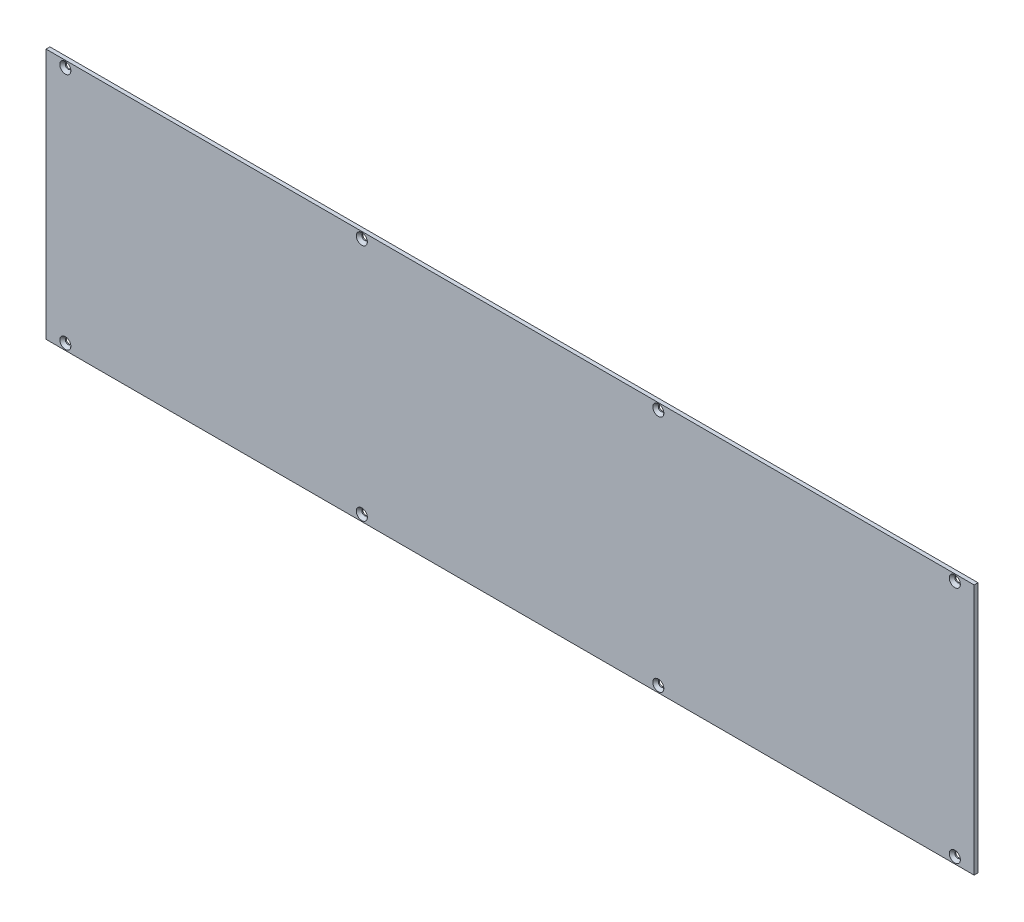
ISO-10303-21;
HEADER;
FILE_DESCRIPTION(('STEP AP214'),'2;1');
FILE_NAME('part.step','',(''),(''),'','','');
FILE_SCHEMA(('AUTOMOTIVE_DESIGN { 1 0 10303 214 1 1 1 1 }'));
ENDSEC;
DATA;
#1=APPLICATION_CONTEXT('core data for automotive mechanical design processes');
#2=APPLICATION_PROTOCOL_DEFINITION('international standard','automotive_design',2000,#1);
#3=PRODUCT_CONTEXT('',#1,'mechanical');
#4=PRODUCT('Part','Part','',(#3));
#5=PRODUCT_RELATED_PRODUCT_CATEGORY('part','',(#4));
#6=PRODUCT_DEFINITION_FORMATION('','',#4);
#7=PRODUCT_DEFINITION_CONTEXT('part definition',#1,'design');
#8=PRODUCT_DEFINITION('design','',#6,#7);
#9=PRODUCT_DEFINITION_SHAPE('','',#8);
#10=(LENGTH_UNIT() NAMED_UNIT(*) SI_UNIT(.MILLI.,.METRE.));
#11=(NAMED_UNIT(*) PLANE_ANGLE_UNIT() SI_UNIT($,.RADIAN.));
#12=(NAMED_UNIT(*) SI_UNIT($,.STERADIAN.) SOLID_ANGLE_UNIT());
#13=UNCERTAINTY_MEASURE_WITH_UNIT(LENGTH_MEASURE(1.E-05),#10,'distance_accuracy_value','');
#14=(GEOMETRIC_REPRESENTATION_CONTEXT(3) GLOBAL_UNCERTAINTY_ASSIGNED_CONTEXT((#13)) GLOBAL_UNIT_ASSIGNED_CONTEXT((#10,
#11,#12)) REPRESENTATION_CONTEXT('',''));
#15=CARTESIAN_POINT('',(0.,0.,0.));
#16=DIRECTION('',(0.,0.,1.));
#17=DIRECTION('',(1.,0.,0.));
#18=AXIS2_PLACEMENT_3D('',#15,#16,#17);
#19=CARTESIAN_POINT('',(-1.77635683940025E-12,1.11022302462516E-12,2.99999999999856));
#20=DIRECTION('',(0.999999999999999,0.,0.));
#21=DIRECTION('',(0.,0.,-1.));
#22=AXIS2_PLACEMENT_3D('',#19,#20,#21);
#23=PLANE('',#22);
#24=DIRECTION('',(0.,-1.,0.));
#25=VECTOR('',#24,1.);
#26=CARTESIAN_POINT('',(0.,0.,0.));
#27=LINE('',#26,#25);
#28=CARTESIAN_POINT('',(-4.88498130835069E-12,195.000000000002,-1.11022302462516E-12));
#29=VERTEX_POINT('',#28);
#30=CARTESIAN_POINT('',(0.,0.,0.));
#31=VERTEX_POINT('',#30);
#32=EDGE_CURVE('E100',#29,#31,#27,.T.);
#33=ORIENTED_EDGE('',*,*,#32,.T.);
#34=DIRECTION('',(0.,0.,-1.));
#35=VECTOR('',#34,1.);
#36=CARTESIAN_POINT('',(-1.77635683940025E-12,1.11022302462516E-12,2.99999999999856));
#37=LINE('',#36,#35);
#38=CARTESIAN_POINT('',(-1.77635683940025E-12,1.11022302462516E-12,2.99999999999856));
#39=VERTEX_POINT('',#38);
#40=EDGE_CURVE('E11',#39,#31,#37,.T.);
#41=ORIENTED_EDGE('',*,*,#40,.F.);
#42=DIRECTION('',(0.,-1.,0.));
#43=VECTOR('',#42,1.);
#44=CARTESIAN_POINT('',(-1.77635683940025E-12,1.11022302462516E-12,2.99999999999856));
#45=LINE('',#44,#43);
#46=CARTESIAN_POINT('',(-4.88498130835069E-12,195.000000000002,2.99999999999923));
#47=VERTEX_POINT('',#46);
#48=EDGE_CURVE('E88',#47,#39,#45,.T.);
#49=ORIENTED_EDGE('',*,*,#48,.F.);
#50=DIRECTION('',(0.,0.,-1.));
#51=VECTOR('',#50,1.);
#52=CARTESIAN_POINT('',(-4.88498130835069E-12,195.000000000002,2.99999999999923));
#53=LINE('',#52,#51);
#54=EDGE_CURVE('E96',#47,#29,#53,.T.);
#55=ORIENTED_EDGE('',*,*,#54,.T.);
#56=EDGE_LOOP('',(#33,#41,#49,#55));
#57=FACE_BOUND('',#56,.T.);
#58=ADVANCED_FACE('F36',(#57),#23,.F.);
#59=CARTESIAN_POINT('',(-1.77635683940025E-12,1.11022302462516E-12,2.99999999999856));
#60=DIRECTION('',(0.,1.,0.));
#61=DIRECTION('',(0.,0.,1.));
#62=AXIS2_PLACEMENT_3D('',#59,#60,#61);
#63=PLANE('',#62);
#64=DIRECTION('',(0.999999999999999,0.,0.));
#65=VECTOR('',#64,1.);
#66=CARTESIAN_POINT('',(0.,0.,0.));
#67=LINE('',#66,#65);
#68=CARTESIAN_POINT('',(719.999999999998,2.1094237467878E-12,2.22044604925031E-13));
#69=VERTEX_POINT('',#68);
#70=EDGE_CURVE('E92',#31,#69,#67,.T.);
#71=ORIENTED_EDGE('',*,*,#70,.T.);
#72=DIRECTION('',(0.,0.,-1.));
#73=VECTOR('',#72,1.);
#74=CARTESIAN_POINT('',(719.999999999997,2.22044604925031E-12,3.00000000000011));
#75=LINE('',#74,#73);
#76=CARTESIAN_POINT('',(719.999999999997,2.22044604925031E-12,3.00000000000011));
#77=VERTEX_POINT('',#76);
#78=EDGE_CURVE('E45',#77,#69,#75,.T.);
#79=ORIENTED_EDGE('',*,*,#78,.F.);
#80=DIRECTION('',(0.999999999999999,0.,0.));
#81=VECTOR('',#80,1.);
#82=CARTESIAN_POINT('',(-1.77635683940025E-12,1.11022302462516E-12,2.99999999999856));
#83=LINE('',#82,#81);
#84=EDGE_CURVE('E83',#39,#77,#83,.T.);
#85=ORIENTED_EDGE('',*,*,#84,.F.);
#86=ORIENTED_EDGE('',*,*,#40,.T.);
#87=EDGE_LOOP('',(#71,#79,#85,#86));
#88=FACE_BOUND('',#87,.T.);
#89=ADVANCED_FACE('F91',(#88),#63,.F.);
#90=CARTESIAN_POINT('',(719.999999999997,2.22044604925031E-12,3.00000000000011));
#91=DIRECTION('',(-0.999999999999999,0.,0.));
#92=DIRECTION('',(0.,0.,1.));
#93=AXIS2_PLACEMENT_3D('',#90,#91,#92);
#94=PLANE('',#93);
#95=DIRECTION('',(0.,1.,0.));
#96=VECTOR('',#95,1.);
#97=CARTESIAN_POINT('',(719.999999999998,2.1094237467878E-12,2.22044604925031E-13));
#98=LINE('',#97,#96);
#99=CARTESIAN_POINT('',(719.999999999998,195.000000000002,0.));
#100=VERTEX_POINT('',#99);
#101=EDGE_CURVE('E70',#69,#100,#98,.T.);
#102=ORIENTED_EDGE('',*,*,#101,.T.);
#103=DIRECTION('',(0.,0.,-1.));
#104=VECTOR('',#103,1.);
#105=CARTESIAN_POINT('',(719.999999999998,195.000000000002,2.99999999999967));
#106=LINE('',#105,#104);
#107=CARTESIAN_POINT('',(719.999999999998,195.000000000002,2.99999999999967));
#108=VERTEX_POINT('',#107);
#109=EDGE_CURVE('E93',#108,#100,#106,.T.);
#110=ORIENTED_EDGE('',*,*,#109,.F.);
#111=DIRECTION('',(0.,1.,0.));
#112=VECTOR('',#111,1.);
#113=CARTESIAN_POINT('',(719.999999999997,2.22044604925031E-12,3.00000000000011));
#114=LINE('',#113,#112);
#115=EDGE_CURVE('E86',#77,#108,#114,.T.);
#116=ORIENTED_EDGE('',*,*,#115,.F.);
#117=ORIENTED_EDGE('',*,*,#78,.T.);
#118=EDGE_LOOP('',(#102,#110,#116,#117));
#119=FACE_BOUND('',#118,.T.);
#120=ADVANCED_FACE('F94',(#119),#94,.F.);
#121=CARTESIAN_POINT('',(-4.88498130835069E-12,195.000000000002,2.99999999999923));
#122=DIRECTION('',(0.,-1.,0.));
#123=DIRECTION('',(0.,0.,-1.));
#124=AXIS2_PLACEMENT_3D('',#121,#122,#123);
#125=PLANE('',#124);
#126=DIRECTION('',(-0.999999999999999,0.,0.));
#127=VECTOR('',#126,1.);
#128=CARTESIAN_POINT('',(-4.88498130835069E-12,195.000000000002,-1.11022302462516E-12));
#129=LINE('',#128,#127);
#130=EDGE_CURVE('E76',#100,#29,#129,.T.);
#131=ORIENTED_EDGE('',*,*,#130,.T.);
#132=ORIENTED_EDGE('',*,*,#54,.F.);
#133=DIRECTION('',(-0.999999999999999,0.,0.));
#134=VECTOR('',#133,1.);
#135=CARTESIAN_POINT('',(-4.88498130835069E-12,195.000000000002,2.99999999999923));
#136=LINE('',#135,#134);
#137=EDGE_CURVE('E53',#108,#47,#136,.T.);
#138=ORIENTED_EDGE('',*,*,#137,.F.);
#139=ORIENTED_EDGE('',*,*,#109,.T.);
#140=EDGE_LOOP('',(#131,#132,#138,#139));
#141=FACE_BOUND('',#140,.T.);
#142=ADVANCED_FACE('F108',(#141),#125,.F.);
#143=CARTESIAN_POINT('',(-1.77635683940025E-12,1.11022302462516E-12,2.99999999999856));
#144=DIRECTION('',(0.,0.,-1.));
#145=DIRECTION('',(-0.999999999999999,0.,0.));
#146=AXIS2_PLACEMENT_3D('',#143,#144,#145);
#147=PLANE('',#146);
#148=CARTESIAN_POINT('',(14.9999999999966,5.00000000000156,2.99999999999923));
#149=DIRECTION('',(0.,0.,1.));
#150=DIRECTION('',(0.999999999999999,0.,0.));
#151=AXIS2_PLACEMENT_3D('',#148,#149,#150);
#152=CIRCLE('',#151,4.3);
#153=CARTESIAN_POINT('',(19.2999999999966,5.00000000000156,2.99999999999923));
#154=VERTEX_POINT('',#153);
#155=EDGE_CURVE('E123',#154,#154,#152,.T.);
#156=ORIENTED_EDGE('',*,*,#155,.F.);
#157=EDGE_LOOP('',(#156));
#158=FACE_BOUND('',#157,.T.);
#159=CARTESIAN_POINT('',(704.999999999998,190.000000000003,3.00000000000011));
#160=DIRECTION('',(0.,0.,1.));
#161=DIRECTION('',(0.999999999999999,0.,0.));
#162=AXIS2_PLACEMENT_3D('',#159,#160,#161);
#163=CIRCLE('',#162,4.29999999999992);
#164=CARTESIAN_POINT('',(709.299999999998,190.000000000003,3.00000000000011));
#165=VERTEX_POINT('',#164);
#166=EDGE_CURVE('E120',#165,#165,#163,.T.);
#167=ORIENTED_EDGE('',*,*,#166,.F.);
#168=EDGE_LOOP('',(#167));
#169=FACE_BOUND('',#168,.T.);
#170=CARTESIAN_POINT('',(474.999999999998,190.000000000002,2.99999999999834));
#171=DIRECTION('',(0.,0.,1.));
#172=DIRECTION('',(0.999999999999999,0.,0.));
#173=AXIS2_PLACEMENT_3D('',#170,#171,#172);
#174=CIRCLE('',#173,4.30000000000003);
#175=CARTESIAN_POINT('',(479.299999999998,190.000000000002,2.99999999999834));
#176=VERTEX_POINT('',#175);
#177=EDGE_CURVE('E117',#176,#176,#174,.T.);
#178=ORIENTED_EDGE('',*,*,#177,.F.);
#179=EDGE_LOOP('',(#178));
#180=FACE_BOUND('',#179,.T.);
#181=CARTESIAN_POINT('',(244.999999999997,190.000000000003,3.00000000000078));
#182=DIRECTION('',(0.,0.,1.));
#183=DIRECTION('',(0.999999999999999,0.,0.));
#184=AXIS2_PLACEMENT_3D('',#181,#182,#183);
#185=CIRCLE('',#184,4.30000000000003);
#186=CARTESIAN_POINT('',(249.299999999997,190.000000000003,3.00000000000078));
#187=VERTEX_POINT('',#186);
#188=EDGE_CURVE('E116',#187,#187,#185,.T.);
#189=ORIENTED_EDGE('',*,*,#188,.F.);
#190=EDGE_LOOP('',(#189));
#191=FACE_BOUND('',#190,.T.);
#192=CARTESIAN_POINT('',(244.999999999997,5.00000000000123,2.99999999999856));
#193=DIRECTION('',(0.,0.,1.));
#194=DIRECTION('',(0.999999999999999,0.,0.));
#195=AXIS2_PLACEMENT_3D('',#192,#193,#194);
#196=CIRCLE('',#195,4.30000000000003);
#197=CARTESIAN_POINT('',(249.299999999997,5.00000000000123,2.99999999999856));
#198=VERTEX_POINT('',#197);
#199=EDGE_CURVE('E126',#198,#198,#196,.T.);
#200=ORIENTED_EDGE('',*,*,#199,.F.);
#201=EDGE_LOOP('',(#200));
#202=FACE_BOUND('',#201,.T.);
#203=CARTESIAN_POINT('',(474.999999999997,5.00000000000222,2.99999999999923));
#204=DIRECTION('',(0.,0.,1.));
#205=DIRECTION('',(0.999999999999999,0.,0.));
#206=AXIS2_PLACEMENT_3D('',#203,#204,#205);
#207=CIRCLE('',#206,4.30000000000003);
#208=CARTESIAN_POINT('',(479.299999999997,5.00000000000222,2.99999999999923));
#209=VERTEX_POINT('',#208);
#210=EDGE_CURVE('E132',#209,#209,#207,.T.);
#211=ORIENTED_EDGE('',*,*,#210,.F.);
#212=EDGE_LOOP('',(#211));
#213=FACE_BOUND('',#212,.T.);
#214=CARTESIAN_POINT('',(704.999999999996,5.00000000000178,2.99999999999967));
#215=DIRECTION('',(0.,0.,1.));
#216=DIRECTION('',(0.999999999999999,0.,0.));
#217=AXIS2_PLACEMENT_3D('',#214,#215,#216);
#218=CIRCLE('',#217,4.29999999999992);
#219=CARTESIAN_POINT('',(709.299999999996,5.00000000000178,2.99999999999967));
#220=VERTEX_POINT('',#219);
#221=EDGE_CURVE('E129',#220,#220,#218,.T.);
#222=ORIENTED_EDGE('',*,*,#221,.F.);
#223=EDGE_LOOP('',(#222));
#224=FACE_BOUND('',#223,.T.);
#225=CARTESIAN_POINT('',(14.9999999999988,190.000000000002,2.99999999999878));
#226=DIRECTION('',(0.,0.,1.));
#227=DIRECTION('',(0.999999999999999,0.,0.));
#228=AXIS2_PLACEMENT_3D('',#225,#226,#227);
#229=CIRCLE('',#228,4.3);
#230=CARTESIAN_POINT('',(19.2999999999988,190.000000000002,2.99999999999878));
#231=VERTEX_POINT('',#230);
#232=EDGE_CURVE('E103',#231,#231,#229,.T.);
#233=ORIENTED_EDGE('',*,*,#232,.F.);
#234=EDGE_LOOP('',(#233));
#235=FACE_BOUND('',#234,.T.);
#236=ORIENTED_EDGE('',*,*,#48,.T.);
#237=ORIENTED_EDGE('',*,*,#84,.T.);
#238=ORIENTED_EDGE('',*,*,#115,.T.);
#239=ORIENTED_EDGE('',*,*,#137,.T.);
#240=EDGE_LOOP('',(#236,#237,#238,#239));
#241=FACE_BOUND('',#240,.T.);
#242=ADVANCED_FACE('F84',(#158,#169,#180,#191,#202,#213,#224,#235,#241),#147,.F.);
#243=CARTESIAN_POINT('',(0.,0.,0.));
#244=DIRECTION('',(0.,0.,-1.));
#245=DIRECTION('',(-0.999999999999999,0.,0.));
#246=AXIS2_PLACEMENT_3D('',#243,#244,#245);
#247=PLANE('',#246);
#248=CARTESIAN_POINT('',(14.999999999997,190.000000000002,-1.11022302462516E-12));
#249=DIRECTION('',(0.,0.,1.));
#250=DIRECTION('',(0.999999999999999,0.,0.));
#251=AXIS2_PLACEMENT_3D('',#248,#249,#250);
#252=CIRCLE('',#251,2.15);
#253=CARTESIAN_POINT('',(17.149999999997,190.000000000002,-1.11022302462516E-12));
#254=VERTEX_POINT('',#253);
#255=EDGE_CURVE('E177',#254,#254,#252,.T.);
#256=ORIENTED_EDGE('',*,*,#255,.T.);
#257=EDGE_LOOP('',(#256));
#258=FACE_BOUND('',#257,.T.);
#259=CARTESIAN_POINT('',(245.,190.000000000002,-1.11022302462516E-12));
#260=DIRECTION('',(0.,0.,1.));
#261=DIRECTION('',(0.999999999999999,0.,0.));
#262=AXIS2_PLACEMENT_3D('',#259,#260,#261);
#263=CIRCLE('',#262,2.15000000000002);
#264=CARTESIAN_POINT('',(247.15,190.000000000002,-1.11022302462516E-12));
#265=VERTEX_POINT('',#264);
#266=EDGE_CURVE('E171',#265,#265,#263,.T.);
#267=ORIENTED_EDGE('',*,*,#266,.T.);
#268=EDGE_LOOP('',(#267));
#269=FACE_BOUND('',#268,.T.);
#270=CARTESIAN_POINT('',(474.999999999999,190.000000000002,-4.44089209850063E-13));
#271=DIRECTION('',(0.,0.,1.));
#272=DIRECTION('',(0.999999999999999,0.,0.));
#273=AXIS2_PLACEMENT_3D('',#270,#271,#272);
#274=CIRCLE('',#273,2.14999999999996);
#275=CARTESIAN_POINT('',(477.149999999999,190.000000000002,-4.44089209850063E-13));
#276=VERTEX_POINT('',#275);
#277=EDGE_CURVE('E165',#276,#276,#274,.T.);
#278=ORIENTED_EDGE('',*,*,#277,.T.);
#279=EDGE_LOOP('',(#278));
#280=FACE_BOUND('',#279,.T.);
#281=CARTESIAN_POINT('',(704.999999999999,190.000000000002,0.));
#282=DIRECTION('',(0.,0.,1.));
#283=DIRECTION('',(0.999999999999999,0.,0.));
#284=AXIS2_PLACEMENT_3D('',#281,#282,#283);
#285=CIRCLE('',#284,2.14999999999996);
#286=CARTESIAN_POINT('',(707.149999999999,190.000000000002,0.));
#287=VERTEX_POINT('',#286);
#288=EDGE_CURVE('E159',#287,#287,#285,.T.);
#289=ORIENTED_EDGE('',*,*,#288,.T.);
#290=EDGE_LOOP('',(#289));
#291=FACE_BOUND('',#290,.T.);
#292=CARTESIAN_POINT('',(704.999999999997,5.00000000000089,0.));
#293=DIRECTION('',(0.,0.,1.));
#294=DIRECTION('',(0.999999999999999,0.,0.));
#295=AXIS2_PLACEMENT_3D('',#292,#293,#294);
#296=CIRCLE('',#295,2.14999999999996);
#297=CARTESIAN_POINT('',(707.149999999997,5.00000000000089,0.));
#298=VERTEX_POINT('',#297);
#299=EDGE_CURVE('E153',#298,#298,#296,.T.);
#300=ORIENTED_EDGE('',*,*,#299,.T.);
#301=EDGE_LOOP('',(#300));
#302=FACE_BOUND('',#301,.T.);
#303=CARTESIAN_POINT('',(474.999999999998,5.00000000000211,-2.22044604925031E-13));
#304=DIRECTION('',(0.,0.,1.));
#305=DIRECTION('',(0.999999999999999,0.,0.));
#306=AXIS2_PLACEMENT_3D('',#303,#304,#305);
#307=CIRCLE('',#306,2.14999999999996);
#308=CARTESIAN_POINT('',(477.149999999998,5.00000000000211,-2.22044604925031E-13));
#309=VERTEX_POINT('',#308);
#310=EDGE_CURVE('E147',#309,#309,#307,.T.);
#311=ORIENTED_EDGE('',*,*,#310,.T.);
#312=EDGE_LOOP('',(#311));
#313=FACE_BOUND('',#312,.T.);
#314=CARTESIAN_POINT('',(244.999999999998,5.00000000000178,-8.88178419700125E-13));
#315=DIRECTION('',(0.,0.,1.));
#316=DIRECTION('',(0.999999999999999,0.,0.));
#317=AXIS2_PLACEMENT_3D('',#314,#315,#316);
#318=CIRCLE('',#317,2.15000000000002);
#319=CARTESIAN_POINT('',(247.149999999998,5.00000000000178,-8.88178419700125E-13));
#320=VERTEX_POINT('',#319);
#321=EDGE_CURVE('E141',#320,#320,#318,.T.);
#322=ORIENTED_EDGE('',*,*,#321,.T.);
#323=EDGE_LOOP('',(#322));
#324=FACE_BOUND('',#323,.T.);
#325=CARTESIAN_POINT('',(14.9999999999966,5.00000000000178,-8.88178419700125E-13));
#326=DIRECTION('',(0.,0.,1.));
#327=DIRECTION('',(0.999999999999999,0.,0.));
#328=AXIS2_PLACEMENT_3D('',#325,#326,#327);
#329=CIRCLE('',#328,2.15);
#330=CARTESIAN_POINT('',(17.1499999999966,5.00000000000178,-8.88178419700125E-13));
#331=VERTEX_POINT('',#330);
#332=EDGE_CURVE('E133',#331,#331,#329,.T.);
#333=ORIENTED_EDGE('',*,*,#332,.T.);
#334=EDGE_LOOP('',(#333));
#335=FACE_BOUND('',#334,.T.);
#336=ORIENTED_EDGE('',*,*,#32,.F.);
#337=ORIENTED_EDGE('',*,*,#130,.F.);
#338=ORIENTED_EDGE('',*,*,#101,.F.);
#339=ORIENTED_EDGE('',*,*,#70,.F.);
#340=EDGE_LOOP('',(#336,#337,#338,#339));
#341=FACE_BOUND('',#340,.T.);
#342=ADVANCED_FACE('F111',(#258,#269,#280,#291,#302,#313,#324,#335,#341),#247,.T.);
#343=CARTESIAN_POINT('',(14.9999999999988,190.000000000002,2.99999999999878));
#344=DIRECTION('',(0.,0.,1.));
#345=DIRECTION('',(0.999999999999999,0.,0.));
#346=AXIS2_PLACEMENT_3D('',#343,#344,#345);
#347=CONICAL_SURFACE('',#346,4.3,0.78539816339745);
#348=CARTESIAN_POINT('',(14.9999999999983,190.000000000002,0.849999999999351));
#349=DIRECTION('',(0.,0.,1.));
#350=DIRECTION('',(0.999999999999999,0.,0.));
#351=AXIS2_PLACEMENT_3D('',#348,#349,#350);
#352=CIRCLE('',#351,2.15);
#353=CARTESIAN_POINT('',(17.1499999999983,190.000000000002,0.849999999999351));
#354=VERTEX_POINT('',#353);
#355=EDGE_CURVE('E180',#354,#354,#352,.T.);
#356=ORIENTED_EDGE('',*,*,#355,.F.);
#357=EDGE_LOOP('',(#356));
#358=FACE_BOUND('',#357,.T.);
#359=ORIENTED_EDGE('',*,*,#232,.T.);
#360=EDGE_LOOP('',(#359));
#361=FACE_BOUND('',#360,.T.);
#362=ADVANCED_FACE('F38',(#358,#361),#347,.F.);
#363=CARTESIAN_POINT('',(704.999999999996,5.00000000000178,2.99999999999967));
#364=DIRECTION('',(0.,0.,1.));
#365=DIRECTION('',(0.999999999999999,0.,0.));
#366=AXIS2_PLACEMENT_3D('',#363,#364,#365);
#367=CONICAL_SURFACE('',#366,4.29999999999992,0.78539816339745);
#368=CARTESIAN_POINT('',(704.999999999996,5.00000000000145,0.849999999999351));
#369=DIRECTION('',(0.,0.,1.));
#370=DIRECTION('',(0.999999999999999,0.,0.));
#371=AXIS2_PLACEMENT_3D('',#368,#369,#370);
#372=CIRCLE('',#371,2.14999999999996);
#373=CARTESIAN_POINT('',(707.149999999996,5.00000000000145,0.849999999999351));
#374=VERTEX_POINT('',#373);
#375=EDGE_CURVE('E156',#374,#374,#372,.T.);
#376=ORIENTED_EDGE('',*,*,#375,.F.);
#377=EDGE_LOOP('',(#376));
#378=FACE_BOUND('',#377,.T.);
#379=ORIENTED_EDGE('',*,*,#221,.T.);
#380=EDGE_LOOP('',(#379));
#381=FACE_BOUND('',#380,.T.);
#382=ADVANCED_FACE('F197',(#378,#381),#367,.F.);
#383=CARTESIAN_POINT('',(474.999999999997,5.00000000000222,2.99999999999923));
#384=DIRECTION('',(0.,0.,1.));
#385=DIRECTION('',(0.999999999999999,0.,0.));
#386=AXIS2_PLACEMENT_3D('',#383,#384,#385);
#387=CONICAL_SURFACE('',#386,4.30000000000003,0.78539816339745);
#388=CARTESIAN_POINT('',(474.999999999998,5.00000000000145,0.849999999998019));
#389=DIRECTION('',(0.,0.,1.));
#390=DIRECTION('',(0.999999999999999,0.,0.));
#391=AXIS2_PLACEMENT_3D('',#388,#389,#390);
#392=CIRCLE('',#391,2.14999999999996);
#393=CARTESIAN_POINT('',(477.149999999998,5.00000000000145,0.849999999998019));
#394=VERTEX_POINT('',#393);
#395=EDGE_CURVE('E150',#394,#394,#392,.T.);
#396=ORIENTED_EDGE('',*,*,#395,.F.);
#397=EDGE_LOOP('',(#396));
#398=FACE_BOUND('',#397,.T.);
#399=ORIENTED_EDGE('',*,*,#210,.T.);
#400=EDGE_LOOP('',(#399));
#401=FACE_BOUND('',#400,.T.);
#402=ADVANCED_FACE('F230',(#398,#401),#387,.F.);
#403=CARTESIAN_POINT('',(244.999999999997,5.00000000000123,2.99999999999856));
#404=DIRECTION('',(0.,0.,1.));
#405=DIRECTION('',(0.999999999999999,0.,0.));
#406=AXIS2_PLACEMENT_3D('',#403,#404,#405);
#407=CONICAL_SURFACE('',#406,4.30000000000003,0.78539816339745);
#408=CARTESIAN_POINT('',(244.999999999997,5.00000000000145,0.849999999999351));
#409=DIRECTION('',(0.,0.,1.));
#410=DIRECTION('',(0.999999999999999,0.,0.));
#411=AXIS2_PLACEMENT_3D('',#408,#409,#410);
#412=CIRCLE('',#411,2.15000000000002);
#413=CARTESIAN_POINT('',(247.149999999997,5.00000000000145,0.849999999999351));
#414=VERTEX_POINT('',#413);
#415=EDGE_CURVE('E144',#414,#414,#412,.T.);
#416=ORIENTED_EDGE('',*,*,#415,.F.);
#417=EDGE_LOOP('',(#416));
#418=FACE_BOUND('',#417,.T.);
#419=ORIENTED_EDGE('',*,*,#199,.T.);
#420=EDGE_LOOP('',(#419));
#421=FACE_BOUND('',#420,.T.);
#422=ADVANCED_FACE('F226',(#418,#421),#407,.F.);
#423=CARTESIAN_POINT('',(244.999999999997,190.000000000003,3.00000000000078));
#424=DIRECTION('',(0.,0.,1.));
#425=DIRECTION('',(0.999999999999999,0.,0.));
#426=AXIS2_PLACEMENT_3D('',#423,#424,#425);
#427=CONICAL_SURFACE('',#426,4.30000000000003,0.78539816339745);
#428=CARTESIAN_POINT('',(245.,190.000000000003,0.849999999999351));
#429=DIRECTION('',(0.,0.,1.));
#430=DIRECTION('',(0.999999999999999,0.,0.));
#431=AXIS2_PLACEMENT_3D('',#428,#429,#430);
#432=CIRCLE('',#431,2.15000000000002);
#433=CARTESIAN_POINT('',(247.15,190.000000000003,0.849999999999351));
#434=VERTEX_POINT('',#433);
#435=EDGE_CURVE('E174',#434,#434,#432,.T.);
#436=ORIENTED_EDGE('',*,*,#435,.F.);
#437=EDGE_LOOP('',(#436));
#438=FACE_BOUND('',#437,.T.);
#439=ORIENTED_EDGE('',*,*,#188,.T.);
#440=EDGE_LOOP('',(#439));
#441=FACE_BOUND('',#440,.T.);
#442=ADVANCED_FACE('F229',(#438,#441),#427,.F.);
#443=CARTESIAN_POINT('',(474.999999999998,190.000000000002,2.99999999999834));
#444=DIRECTION('',(0.,0.,1.));
#445=DIRECTION('',(0.999999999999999,0.,0.));
#446=AXIS2_PLACEMENT_3D('',#443,#444,#445);
#447=CONICAL_SURFACE('',#446,4.30000000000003,0.78539816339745);
#448=CARTESIAN_POINT('',(474.999999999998,190.000000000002,0.849999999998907));
#449=DIRECTION('',(0.,0.,1.));
#450=DIRECTION('',(0.999999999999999,0.,0.));
#451=AXIS2_PLACEMENT_3D('',#448,#449,#450);
#452=CIRCLE('',#451,2.14999999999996);
#453=CARTESIAN_POINT('',(477.149999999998,190.000000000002,0.849999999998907));
#454=VERTEX_POINT('',#453);
#455=EDGE_CURVE('E168',#454,#454,#452,.T.);
#456=ORIENTED_EDGE('',*,*,#455,.F.);
#457=EDGE_LOOP('',(#456));
#458=FACE_BOUND('',#457,.T.);
#459=ORIENTED_EDGE('',*,*,#177,.T.);
#460=EDGE_LOOP('',(#459));
#461=FACE_BOUND('',#460,.T.);
#462=ADVANCED_FACE('F240',(#458,#461),#447,.F.);
#463=CARTESIAN_POINT('',(704.999999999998,190.000000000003,3.00000000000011));
#464=DIRECTION('',(0.,0.,1.));
#465=DIRECTION('',(0.999999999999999,0.,0.));
#466=AXIS2_PLACEMENT_3D('',#463,#464,#465);
#467=CONICAL_SURFACE('',#466,4.29999999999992,0.78539816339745);
#468=CARTESIAN_POINT('',(704.999999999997,190.000000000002,0.850000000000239));
#469=DIRECTION('',(0.,0.,1.));
#470=DIRECTION('',(0.999999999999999,0.,0.));
#471=AXIS2_PLACEMENT_3D('',#468,#469,#470);
#472=CIRCLE('',#471,2.14999999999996);
#473=CARTESIAN_POINT('',(707.149999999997,190.000000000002,0.850000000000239));
#474=VERTEX_POINT('',#473);
#475=EDGE_CURVE('E162',#474,#474,#472,.T.);
#476=ORIENTED_EDGE('',*,*,#475,.F.);
#477=EDGE_LOOP('',(#476));
#478=FACE_BOUND('',#477,.T.);
#479=ORIENTED_EDGE('',*,*,#166,.T.);
#480=EDGE_LOOP('',(#479));
#481=FACE_BOUND('',#480,.T.);
#482=ADVANCED_FACE('F224',(#478,#481),#467,.F.);
#483=CARTESIAN_POINT('',(14.9999999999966,5.00000000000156,2.99999999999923));
#484=DIRECTION('',(0.,0.,1.));
#485=DIRECTION('',(0.999999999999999,0.,0.));
#486=AXIS2_PLACEMENT_3D('',#483,#484,#485);
#487=CONICAL_SURFACE('',#486,4.3,0.78539816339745);
#488=CARTESIAN_POINT('',(14.999999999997,5.00000000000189,0.849999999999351));
#489=DIRECTION('',(0.,0.,1.));
#490=DIRECTION('',(0.999999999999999,0.,0.));
#491=AXIS2_PLACEMENT_3D('',#488,#489,#490);
#492=CIRCLE('',#491,2.15);
#493=CARTESIAN_POINT('',(17.149999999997,5.00000000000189,0.849999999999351));
#494=VERTEX_POINT('',#493);
#495=EDGE_CURVE('E138',#494,#494,#492,.T.);
#496=ORIENTED_EDGE('',*,*,#495,.F.);
#497=EDGE_LOOP('',(#496));
#498=FACE_BOUND('',#497,.T.);
#499=ORIENTED_EDGE('',*,*,#155,.T.);
#500=EDGE_LOOP('',(#499));
#501=FACE_BOUND('',#500,.T.);
#502=ADVANCED_FACE('F220',(#498,#501),#487,.F.);
#503=CARTESIAN_POINT('',(14.9999999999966,5.00000000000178,-8.88178419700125E-13));
#504=DIRECTION('',(0.,0.,1.));
#505=DIRECTION('',(0.999999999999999,0.,0.));
#506=AXIS2_PLACEMENT_3D('',#503,#504,#505);
#507=CYLINDRICAL_SURFACE('',#506,2.15);
#508=ORIENTED_EDGE('',*,*,#332,.F.);
#509=EDGE_LOOP('',(#508));
#510=FACE_BOUND('',#509,.T.);
#511=ORIENTED_EDGE('',*,*,#495,.T.);
#512=EDGE_LOOP('',(#511));
#513=FACE_BOUND('',#512,.T.);
#514=ADVANCED_FACE('F223',(#510,#513),#507,.F.);
#515=CARTESIAN_POINT('',(244.999999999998,5.00000000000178,-8.88178419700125E-13));
#516=DIRECTION('',(0.,0.,1.));
#517=DIRECTION('',(0.999999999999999,0.,0.));
#518=AXIS2_PLACEMENT_3D('',#515,#516,#517);
#519=CYLINDRICAL_SURFACE('',#518,2.15000000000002);
#520=ORIENTED_EDGE('',*,*,#321,.F.);
#521=EDGE_LOOP('',(#520));
#522=FACE_BOUND('',#521,.T.);
#523=ORIENTED_EDGE('',*,*,#415,.T.);
#524=EDGE_LOOP('',(#523));
#525=FACE_BOUND('',#524,.T.);
#526=ADVANCED_FACE('F284',(#522,#525),#519,.F.);
#527=CARTESIAN_POINT('',(474.999999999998,5.00000000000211,-2.22044604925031E-13));
#528=DIRECTION('',(0.,0.,1.));
#529=DIRECTION('',(0.999999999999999,0.,0.));
#530=AXIS2_PLACEMENT_3D('',#527,#528,#529);
#531=CYLINDRICAL_SURFACE('',#530,2.14999999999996);
#532=ORIENTED_EDGE('',*,*,#310,.F.);
#533=EDGE_LOOP('',(#532));
#534=FACE_BOUND('',#533,.T.);
#535=ORIENTED_EDGE('',*,*,#395,.T.);
#536=EDGE_LOOP('',(#535));
#537=FACE_BOUND('',#536,.T.);
#538=ADVANCED_FACE('F280',(#534,#537),#531,.F.);
#539=CARTESIAN_POINT('',(704.999999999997,5.00000000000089,0.));
#540=DIRECTION('',(0.,0.,1.));
#541=DIRECTION('',(0.999999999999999,0.,0.));
#542=AXIS2_PLACEMENT_3D('',#539,#540,#541);
#543=CYLINDRICAL_SURFACE('',#542,2.14999999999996);
#544=ORIENTED_EDGE('',*,*,#299,.F.);
#545=EDGE_LOOP('',(#544));
#546=FACE_BOUND('',#545,.T.);
#547=ORIENTED_EDGE('',*,*,#375,.T.);
#548=EDGE_LOOP('',(#547));
#549=FACE_BOUND('',#548,.T.);
#550=ADVANCED_FACE('F276',(#546,#549),#543,.F.);
#551=CARTESIAN_POINT('',(704.999999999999,190.000000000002,0.));
#552=DIRECTION('',(0.,0.,1.));
#553=DIRECTION('',(0.999999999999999,0.,0.));
#554=AXIS2_PLACEMENT_3D('',#551,#552,#553);
#555=CYLINDRICAL_SURFACE('',#554,2.14999999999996);
#556=ORIENTED_EDGE('',*,*,#288,.F.);
#557=EDGE_LOOP('',(#556));
#558=FACE_BOUND('',#557,.T.);
#559=ORIENTED_EDGE('',*,*,#475,.T.);
#560=EDGE_LOOP('',(#559));
#561=FACE_BOUND('',#560,.T.);
#562=ADVANCED_FACE('F269',(#558,#561),#555,.F.);
#563=CARTESIAN_POINT('',(474.999999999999,190.000000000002,-4.44089209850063E-13));
#564=DIRECTION('',(0.,0.,1.));
#565=DIRECTION('',(0.999999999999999,0.,0.));
#566=AXIS2_PLACEMENT_3D('',#563,#564,#565);
#567=CYLINDRICAL_SURFACE('',#566,2.14999999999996);
#568=ORIENTED_EDGE('',*,*,#277,.F.);
#569=EDGE_LOOP('',(#568));
#570=FACE_BOUND('',#569,.T.);
#571=ORIENTED_EDGE('',*,*,#455,.T.);
#572=EDGE_LOOP('',(#571));
#573=FACE_BOUND('',#572,.T.);
#574=ADVANCED_FACE('F263',(#570,#573),#567,.F.);
#575=CARTESIAN_POINT('',(245.,190.000000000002,-1.11022302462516E-12));
#576=DIRECTION('',(0.,0.,1.));
#577=DIRECTION('',(0.999999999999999,0.,0.));
#578=AXIS2_PLACEMENT_3D('',#575,#576,#577);
#579=CYLINDRICAL_SURFACE('',#578,2.15000000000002);
#580=ORIENTED_EDGE('',*,*,#266,.F.);
#581=EDGE_LOOP('',(#580));
#582=FACE_BOUND('',#581,.T.);
#583=ORIENTED_EDGE('',*,*,#435,.T.);
#584=EDGE_LOOP('',(#583));
#585=FACE_BOUND('',#584,.T.);
#586=ADVANCED_FACE('F191',(#582,#585),#579,.F.);
#587=CARTESIAN_POINT('',(14.999999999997,190.000000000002,-1.11022302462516E-12));
#588=DIRECTION('',(0.,0.,1.));
#589=DIRECTION('',(0.999999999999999,0.,0.));
#590=AXIS2_PLACEMENT_3D('',#587,#588,#589);
#591=CYLINDRICAL_SURFACE('',#590,2.15);
#592=ORIENTED_EDGE('',*,*,#255,.F.);
#593=EDGE_LOOP('',(#592));
#594=FACE_BOUND('',#593,.T.);
#595=ORIENTED_EDGE('',*,*,#355,.T.);
#596=EDGE_LOOP('',(#595));
#597=FACE_BOUND('',#596,.T.);
#598=ADVANCED_FACE('F188',(#594,#597),#591,.F.);
#599=CLOSED_SHELL('',(#58,#89,#120,#142,#242,#342,#362,#382,#402,#422,#442,#462,#482,#502,#514,
#526,#538,#550,#562,#574,#586,#598));
#600=MANIFOLD_SOLID_BREP('B2',#599);
#601=ADVANCED_BREP_SHAPE_REPRESENTATION('',(#18,#600),#14);
#602=SHAPE_DEFINITION_REPRESENTATION(#9,#601);
ENDSEC;
END-ISO-10303-21;
